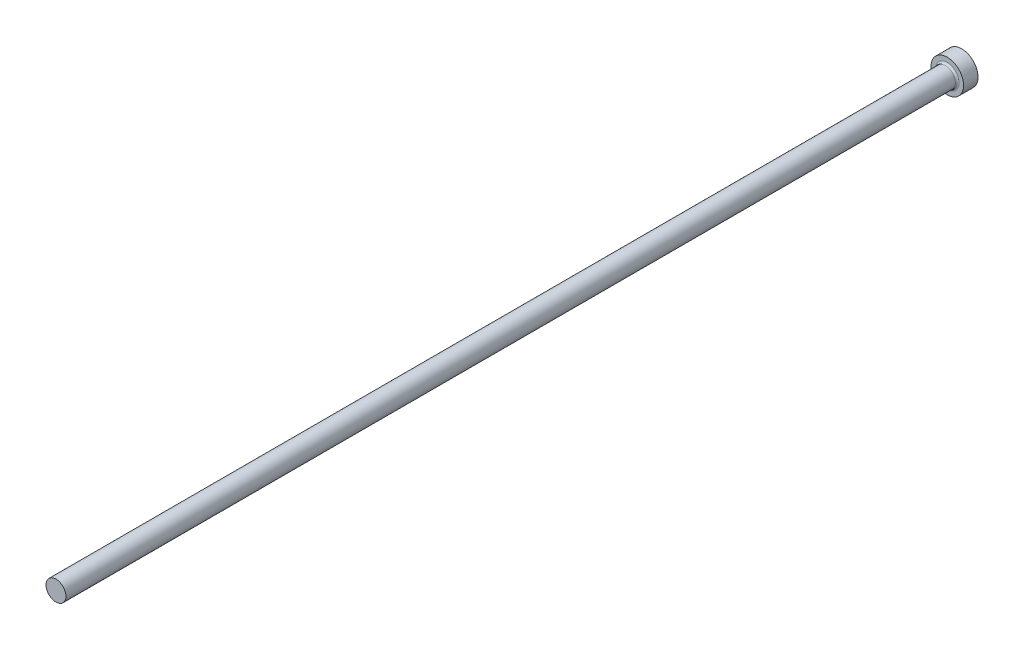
from build123d import *

# Parameters (mm, degrees)
FILLET1_R = 0.5


with BuildPart() as part:
    # FV → Revolve1 (revolve)
    with BuildSketch(Plane(origin=(0, 0, 0), x_dir=(1, 0, 0), z_dir=(0, 1, 0)), mode=Mode.PRIVATE) as revolve1_sk:
        Polygon((0, 0), (4.5, 0), (4.5, -4), (2.75, -4), (2.75, -250), (0, -250), align=None)
    revolve(revolve1_sk.sketch.rotate(Axis((0, 0, -9.033228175), (0, 0, 1)), 180), axis=Axis((0, 0, -9.033228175), (0, 0, 1)))

    # Fillet1
    fillet1_edges = [part.edges().sort_by_distance(p)[0] for p in [
        (2.75, 0, 4),
    ]]
    fillet(fillet1_edges, radius=FILLET1_R)


solid = part.part
